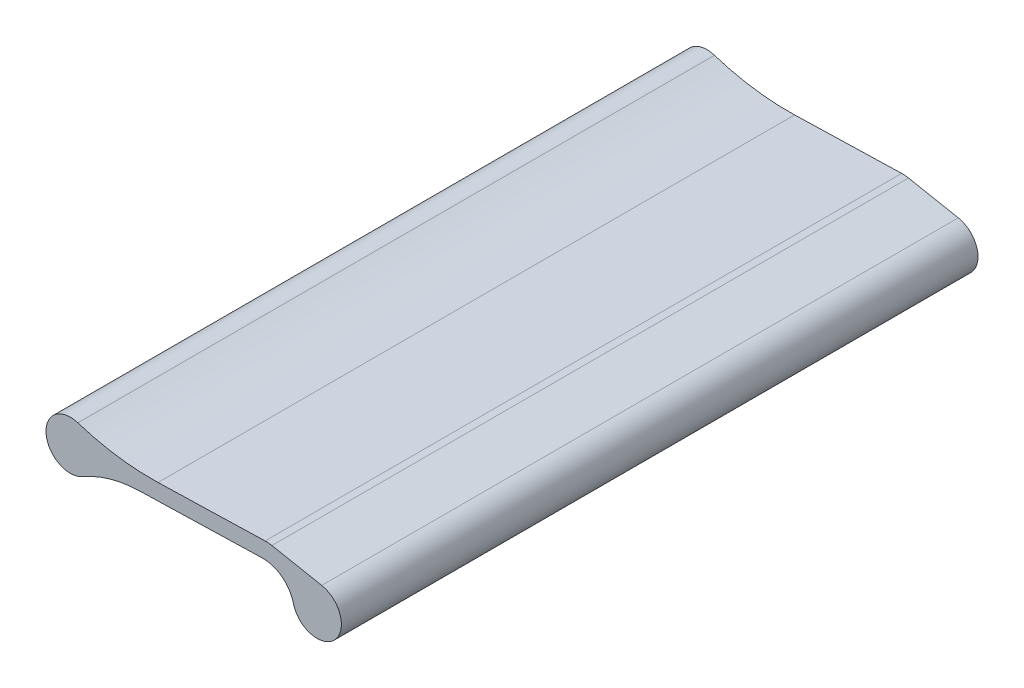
ISO-10303-21;
HEADER;
FILE_DESCRIPTION(('STEP AP214'),'2;1');
FILE_NAME('part.step','',(''),(''),'','','');
FILE_SCHEMA(('AUTOMOTIVE_DESIGN { 1 0 10303 214 1 1 1 1 }'));
ENDSEC;
DATA;
#1=APPLICATION_CONTEXT('core data for automotive mechanical design processes');
#2=APPLICATION_PROTOCOL_DEFINITION('international standard','automotive_design',2000,#1);
#3=PRODUCT_CONTEXT('',#1,'mechanical');
#4=PRODUCT('Part','Part','',(#3));
#5=PRODUCT_RELATED_PRODUCT_CATEGORY('part','',(#4));
#6=PRODUCT_DEFINITION_FORMATION('','',#4);
#7=PRODUCT_DEFINITION_CONTEXT('part definition',#1,'design');
#8=PRODUCT_DEFINITION('design','',#6,#7);
#9=PRODUCT_DEFINITION_SHAPE('','',#8);
#10=(LENGTH_UNIT() NAMED_UNIT(*) SI_UNIT(.MILLI.,.METRE.));
#11=(NAMED_UNIT(*) PLANE_ANGLE_UNIT() SI_UNIT($,.RADIAN.));
#12=(NAMED_UNIT(*) SI_UNIT($,.STERADIAN.) SOLID_ANGLE_UNIT());
#13=UNCERTAINTY_MEASURE_WITH_UNIT(LENGTH_MEASURE(1.E-05),#10,'distance_accuracy_value','');
#14=(GEOMETRIC_REPRESENTATION_CONTEXT(3) GLOBAL_UNCERTAINTY_ASSIGNED_CONTEXT((#13)) GLOBAL_UNIT_ASSIGNED_CONTEXT((#10,
#11,#12)) REPRESENTATION_CONTEXT('',''));
#15=CARTESIAN_POINT('',(0.,0.,0.));
#16=DIRECTION('',(0.,0.,1.));
#17=DIRECTION('',(1.,0.,0.));
#18=AXIS2_PLACEMENT_3D('',#15,#16,#17);
#19=CARTESIAN_POINT('',(-21.5440500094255,-0.697506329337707,0.));
#20=DIRECTION('',(0.,0.,1.));
#21=DIRECTION('',(1.,0.,0.));
#22=AXIS2_PLACEMENT_3D('',#19,#20,#21);
#23=CYLINDRICAL_SURFACE('',#22,3.96000000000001);
#24=CARTESIAN_POINT('',(-21.5440500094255,-0.697506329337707,0.));
#25=DIRECTION('',(0.,0.,1.));
#26=DIRECTION('',(1.,0.,0.));
#27=AXIS2_PLACEMENT_3D('',#24,#25,#26);
#28=CIRCLE('',#27,3.96000000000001);
#29=CARTESIAN_POINT('',(-20.7918012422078,3.19038793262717,0.));
#30=VERTEX_POINT('',#29);
#31=CARTESIAN_POINT('',(-21.6511268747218,3.26104574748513,0.));
#32=VERTEX_POINT('',#31);
#33=EDGE_CURVE('E95',#30,#32,#28,.T.);
#34=ORIENTED_EDGE('',*,*,#33,.T.);
#35=DIRECTION('',(0.,0.,1.));
#36=VECTOR('',#35,1.);
#37=CARTESIAN_POINT('',(-21.6511268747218,3.26104574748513,0.));
#38=LINE('',#37,#36);
#39=CARTESIAN_POINT('',(-21.6511268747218,3.26104574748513,80.));
#40=VERTEX_POINT('',#39);
#41=EDGE_CURVE('E93',#40,#32,#38,.F.);
#42=ORIENTED_EDGE('',*,*,#41,.F.);
#43=CARTESIAN_POINT('',(-21.5440500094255,-0.697506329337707,80.));
#44=DIRECTION('',(0.,0.,1.));
#45=DIRECTION('',(1.,0.,0.));
#46=AXIS2_PLACEMENT_3D('',#43,#44,#45);
#47=CIRCLE('',#46,3.96000000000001);
#48=CARTESIAN_POINT('',(-20.7918012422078,3.19038793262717,80.));
#49=VERTEX_POINT('',#48);
#50=EDGE_CURVE('E20',#40,#49,#47,.F.);
#51=ORIENTED_EDGE('',*,*,#50,.T.);
#52=DIRECTION('',(0.,0.,1.));
#53=VECTOR('',#52,1.);
#54=CARTESIAN_POINT('',(-20.7918012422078,3.19038793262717,0.));
#55=LINE('',#54,#53);
#56=EDGE_CURVE('E90',#30,#49,#55,.T.);
#57=ORIENTED_EDGE('',*,*,#56,.F.);
#58=EDGE_LOOP('',(#34,#42,#51,#57));
#59=FACE_BOUND('',#58,.T.);
#60=ADVANCED_FACE('F17',(#59),#23,.T.);
#61=CARTESIAN_POINT('',(-35.9162883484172,32.9261679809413,0.));
#62=DIRECTION('',(0.,0.,1.));
#63=DIRECTION('',(1.,0.,0.));
#64=AXIS2_PLACEMENT_3D('',#61,#62,#63);
#65=CYLINDRICAL_SURFACE('',#64,30.04);
#66=DIRECTION('',(0.,0.,1.));
#67=VECTOR('',#66,1.);
#68=CARTESIAN_POINT('',(-35.1040183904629,2.89715172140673,0.));
#69=LINE('',#68,#67);
#70=CARTESIAN_POINT('',(-35.1040183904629,2.89715172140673,0.));
#71=VERTEX_POINT('',#70);
#72=CARTESIAN_POINT('',(-35.1040183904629,2.89715172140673,80.));
#73=VERTEX_POINT('',#72);
#74=EDGE_CURVE('E125',#71,#73,#69,.T.);
#75=ORIENTED_EDGE('',*,*,#74,.F.);
#76=CARTESIAN_POINT('',(-35.9162883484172,32.9261679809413,0.));
#77=DIRECTION('',(0.,0.,1.));
#78=DIRECTION('',(1.,0.,0.));
#79=AXIS2_PLACEMENT_3D('',#76,#77,#78);
#80=CIRCLE('',#79,30.04);
#81=CARTESIAN_POINT('',(-45.1782071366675,4.34963109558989,0.));
#82=VERTEX_POINT('',#81);
#83=EDGE_CURVE('E140',#71,#82,#80,.F.);
#84=ORIENTED_EDGE('',*,*,#83,.T.);
#85=DIRECTION('',(0.,0.,1.));
#86=VECTOR('',#85,1.);
#87=CARTESIAN_POINT('',(-45.1782071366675,4.34963109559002,0.));
#88=LINE('',#87,#86);
#89=CARTESIAN_POINT('',(-45.1782071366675,4.34963109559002,80.));
#90=VERTEX_POINT('',#89);
#91=EDGE_CURVE('E103',#90,#82,#88,.F.);
#92=ORIENTED_EDGE('',*,*,#91,.F.);
#93=CARTESIAN_POINT('',(-35.9162883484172,32.9261679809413,80.));
#94=DIRECTION('',(0.,0.,1.));
#95=DIRECTION('',(1.,0.,0.));
#96=AXIS2_PLACEMENT_3D('',#93,#94,#95);
#97=CIRCLE('',#96,30.04);
#98=EDGE_CURVE('E119',#73,#90,#97,.F.);
#99=ORIENTED_EDGE('',*,*,#98,.F.);
#100=EDGE_LOOP('',(#75,#84,#92,#99));
#101=FACE_BOUND('',#100,.T.);
#102=ADVANCED_FACE('F175',(#101),#65,.F.);
#103=CARTESIAN_POINT('',(-46.1216649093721,1.43870556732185,0.));
#104=DIRECTION('',(0.,0.,1.));
#105=DIRECTION('',(1.,0.,0.));
#106=AXIS2_PLACEMENT_3D('',#103,#104,#105);
#107=CYLINDRICAL_SURFACE('',#106,3.06);
#108=CARTESIAN_POINT('',(-46.1216649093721,1.43870556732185,0.));
#109=DIRECTION('',(0.,0.,1.));
#110=DIRECTION('',(1.,0.,0.));
#111=AXIS2_PLACEMENT_3D('',#108,#109,#110);
#112=CIRCLE('',#111,3.06);
#113=CARTESIAN_POINT('',(-44.587359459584,-1.20884174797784,0.));
#114=VERTEX_POINT('',#113);
#115=EDGE_CURVE('E138',#82,#114,#112,.T.);
#116=ORIENTED_EDGE('',*,*,#115,.T.);
#117=DIRECTION('',(0.,0.,1.));
#118=VECTOR('',#117,1.);
#119=CARTESIAN_POINT('',(-44.587359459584,-1.20884174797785,0.));
#120=LINE('',#119,#118);
#121=CARTESIAN_POINT('',(-44.587359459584,-1.20884174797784,80.));
#122=VERTEX_POINT('',#121);
#123=EDGE_CURVE('E108',#114,#122,#120,.T.);
#124=ORIENTED_EDGE('',*,*,#123,.T.);
#125=CARTESIAN_POINT('',(-46.1216649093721,1.43870556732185,80.));
#126=DIRECTION('',(0.,0.,1.));
#127=DIRECTION('',(1.,0.,0.));
#128=AXIS2_PLACEMENT_3D('',#125,#126,#127);
#129=CIRCLE('',#128,3.06);
#130=EDGE_CURVE('E112',#90,#122,#129,.T.);
#131=ORIENTED_EDGE('',*,*,#130,.F.);
#132=ORIENTED_EDGE('',*,*,#91,.T.);
#133=EDGE_LOOP('',(#116,#124,#131,#132));
#134=FACE_BOUND('',#133,.T.);
#135=ADVANCED_FACE('F171',(#134),#107,.T.);
#136=CARTESIAN_POINT('',(-20.7918012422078,3.19038793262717,0.));
#137=DIRECTION('',(0.189961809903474,0.981791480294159,0.));
#138=DIRECTION('',(-0.981791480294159,0.189961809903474,0.));
#139=AXIS2_PLACEMENT_3D('',#136,#137,#138);
#140=PLANE('',#139);
#141=DIRECTION('',(-0.981791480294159,0.189961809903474,0.));
#142=VECTOR('',#141,1.);
#143=CARTESIAN_POINT('',(-14.5380341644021,1.98037853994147,0.));
#144=LINE('',#143,#142);
#145=CARTESIAN_POINT('',(-14.5380341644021,1.98037853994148,0.));
#146=VERTEX_POINT('',#145);
#147=EDGE_CURVE('E102',#146,#30,#144,.T.);
#148=ORIENTED_EDGE('',*,*,#147,.T.);
#149=ORIENTED_EDGE('',*,*,#56,.T.);
#150=DIRECTION('',(-0.981791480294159,0.189961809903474,0.));
#151=VECTOR('',#150,1.);
#152=CARTESIAN_POINT('',(-14.5380341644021,1.98037853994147,80.));
#153=LINE('',#152,#151);
#154=CARTESIAN_POINT('',(-14.5380341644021,1.98037853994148,80.));
#155=VERTEX_POINT('',#154);
#156=EDGE_CURVE('E99',#155,#49,#153,.T.);
#157=ORIENTED_EDGE('',*,*,#156,.F.);
#158=DIRECTION('',(0.,0.,1.));
#159=VECTOR('',#158,1.);
#160=CARTESIAN_POINT('',(-14.5380341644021,1.98037853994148,0.));
#161=LINE('',#160,#159);
#162=EDGE_CURVE('E120',#146,#155,#161,.T.);
#163=ORIENTED_EDGE('',*,*,#162,.F.);
#164=EDGE_LOOP('',(#148,#149,#157,#163));
#165=FACE_BOUND('',#164,.T.);
#166=ADVANCED_FACE('F98',(#165),#140,.T.);
#167=CARTESIAN_POINT('',(-35.1040183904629,2.89715172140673,0.));
#168=DIRECTION('',(-0.027039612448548,0.999634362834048,0.));
#169=DIRECTION('',(-0.999634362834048,-0.027039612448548,0.));
#170=AXIS2_PLACEMENT_3D('',#167,#168,#169);
#171=PLANE('',#170);
#172=DIRECTION('',(-0.999634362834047,-0.0270396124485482,0.));
#173=VECTOR('',#172,1.);
#174=CARTESIAN_POINT('',(-21.6511268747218,3.26104574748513,0.));
#175=LINE('',#174,#173);
#176=EDGE_CURVE('E123',#32,#71,#175,.T.);
#177=ORIENTED_EDGE('',*,*,#176,.T.);
#178=ORIENTED_EDGE('',*,*,#74,.T.);
#179=DIRECTION('',(-0.999634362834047,-0.0270396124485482,0.));
#180=VECTOR('',#179,1.);
#181=CARTESIAN_POINT('',(-21.6511268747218,3.26104574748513,80.));
#182=LINE('',#181,#180);
#183=EDGE_CURVE('E117',#40,#73,#182,.T.);
#184=ORIENTED_EDGE('',*,*,#183,.F.);
#185=ORIENTED_EDGE('',*,*,#41,.T.);
#186=EDGE_LOOP('',(#177,#178,#184,#185));
#187=FACE_BOUND('',#186,.T.);
#188=ADVANCED_FACE('F149',(#187),#171,.T.);
#189=CARTESIAN_POINT('',(-15.1193173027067,-1.02390338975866,0.));
#190=DIRECTION('',(0.,0.,1.));
#191=DIRECTION('',(1.,0.,0.));
#192=AXIS2_PLACEMENT_3D('',#189,#190,#191);
#193=CYLINDRICAL_SURFACE('',#192,3.06000000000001);
#194=CARTESIAN_POINT('',(-15.1193173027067,-1.02390338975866,0.));
#195=DIRECTION('',(0.,0.,1.));
#196=DIRECTION('',(1.,0.,0.));
#197=AXIS2_PLACEMENT_3D('',#194,#195,#196);
#198=CIRCLE('',#197,3.06000000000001);
#199=CARTESIAN_POINT('',(-18.089413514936,-1.76019714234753,0.));
#200=VERTEX_POINT('',#199);
#201=EDGE_CURVE('E133',#200,#146,#198,.T.);
#202=ORIENTED_EDGE('',*,*,#201,.T.);
#203=ORIENTED_EDGE('',*,*,#162,.T.);
#204=CARTESIAN_POINT('',(-15.1193173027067,-1.02390338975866,80.));
#205=DIRECTION('',(0.,0.,1.));
#206=DIRECTION('',(1.,0.,0.));
#207=AXIS2_PLACEMENT_3D('',#204,#205,#206);
#208=CIRCLE('',#207,3.06000000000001);
#209=CARTESIAN_POINT('',(-18.089413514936,-1.76019714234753,80.));
#210=VERTEX_POINT('',#209);
#211=EDGE_CURVE('E107',#210,#155,#208,.T.);
#212=ORIENTED_EDGE('',*,*,#211,.F.);
#213=DIRECTION('',(0.,0.,1.));
#214=VECTOR('',#213,1.);
#215=CARTESIAN_POINT('',(-18.089413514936,-1.76019714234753,0.));
#216=LINE('',#215,#214);
#217=EDGE_CURVE('E121',#210,#200,#216,.F.);
#218=ORIENTED_EDGE('',*,*,#217,.T.);
#219=EDGE_LOOP('',(#202,#203,#212,#218));
#220=FACE_BOUND('',#219,.T.);
#221=ADVANCED_FACE('F198',(#220),#193,.T.);
#222=CARTESIAN_POINT('',(-30.3199559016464,1.26063783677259,80.));
#223=DIRECTION('',(0.,0.,1.));
#224=DIRECTION('',(1.,0.,0.));
#225=AXIS2_PLACEMENT_3D('',#222,#223,#224);
#226=PLANE('',#225);
#227=ORIENTED_EDGE('',*,*,#211,.T.);
#228=ORIENTED_EDGE('',*,*,#156,.T.);
#229=ORIENTED_EDGE('',*,*,#50,.F.);
#230=ORIENTED_EDGE('',*,*,#183,.T.);
#231=ORIENTED_EDGE('',*,*,#98,.T.);
#232=ORIENTED_EDGE('',*,*,#130,.T.);
#233=CARTESIAN_POINT('',(-37.0461980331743,-14.2216233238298,80.));
#234=DIRECTION('',(0.,0.,1.));
#235=DIRECTION('',(1.,0.,0.));
#236=AXIS2_PLACEMENT_3D('',#233,#234,#235);
#237=CIRCLE('',#236,15.04);
#238=CARTESIAN_POINT('',(-37.4528738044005,0.812877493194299,80.));
#239=VERTEX_POINT('',#238);
#240=EDGE_CURVE('E110',#122,#239,#237,.F.);
#241=ORIENTED_EDGE('',*,*,#240,.T.);
#242=DIRECTION('',(0.999634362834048,0.027039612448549,0.));
#243=VECTOR('',#242,1.);
#244=CARTESIAN_POINT('',(-22.0201911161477,1.2303238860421,80.));
#245=LINE('',#244,#243);
#246=CARTESIAN_POINT('',(-22.0201911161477,1.2303238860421,80.));
#247=VERTEX_POINT('',#246);
#248=EDGE_CURVE('E116',#247,#239,#245,.F.);
#249=ORIENTED_EDGE('',*,*,#248,.F.);
#250=CARTESIAN_POINT('',(-21.9136550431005,-2.70823550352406,80.));
#251=DIRECTION('',(0.,0.,1.));
#252=DIRECTION('',(1.,0.,0.));
#253=AXIS2_PLACEMENT_3D('',#250,#251,#252);
#254=CIRCLE('',#253,3.94000000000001);
#255=EDGE_CURVE('E130',#247,#210,#254,.F.);
#256=ORIENTED_EDGE('',*,*,#255,.T.);
#257=EDGE_LOOP('',(#227,#228,#229,#230,#231,#232,#241,#249,#256));
#258=FACE_BOUND('',#257,.T.);
#259=ADVANCED_FACE('F105',(#258),#226,.T.);
#260=CARTESIAN_POINT('',(-37.0461980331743,-14.2216233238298,0.));
#261=DIRECTION('',(0.,0.,1.));
#262=DIRECTION('',(1.,0.,0.));
#263=AXIS2_PLACEMENT_3D('',#260,#261,#262);
#264=CYLINDRICAL_SURFACE('',#263,15.04);
#265=ORIENTED_EDGE('',*,*,#123,.F.);
#266=CARTESIAN_POINT('',(-37.0461980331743,-14.2216233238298,0.));
#267=DIRECTION('',(0.,0.,1.));
#268=DIRECTION('',(1.,0.,0.));
#269=AXIS2_PLACEMENT_3D('',#266,#267,#268);
#270=CIRCLE('',#269,15.04);
#271=CARTESIAN_POINT('',(-37.4528738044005,0.812877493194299,0.));
#272=VERTEX_POINT('',#271);
#273=EDGE_CURVE('E136',#114,#272,#270,.F.);
#274=ORIENTED_EDGE('',*,*,#273,.T.);
#275=DIRECTION('',(0.,0.,1.));
#276=VECTOR('',#275,1.);
#277=CARTESIAN_POINT('',(-37.4528738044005,0.812877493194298,0.));
#278=LINE('',#277,#276);
#279=EDGE_CURVE('E156',#239,#272,#278,.F.);
#280=ORIENTED_EDGE('',*,*,#279,.F.);
#281=ORIENTED_EDGE('',*,*,#240,.F.);
#282=EDGE_LOOP('',(#265,#274,#280,#281));
#283=FACE_BOUND('',#282,.T.);
#284=ADVANCED_FACE('F167',(#283),#264,.F.);
#285=CARTESIAN_POINT('',(-30.3199559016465,1.26063783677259,0.));
#286=DIRECTION('',(0.,0.,1.));
#287=DIRECTION('',(1.,0.,0.));
#288=AXIS2_PLACEMENT_3D('',#285,#286,#287);
#289=PLANE('',#288);
#290=ORIENTED_EDGE('',*,*,#33,.F.);
#291=ORIENTED_EDGE('',*,*,#147,.F.);
#292=ORIENTED_EDGE('',*,*,#201,.F.);
#293=CARTESIAN_POINT('',(-21.9136550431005,-2.70823550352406,0.));
#294=DIRECTION('',(0.,0.,1.));
#295=DIRECTION('',(1.,0.,0.));
#296=AXIS2_PLACEMENT_3D('',#293,#294,#295);
#297=CIRCLE('',#296,3.94000000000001);
#298=CARTESIAN_POINT('',(-22.0201911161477,1.2303238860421,0.));
#299=VERTEX_POINT('',#298);
#300=EDGE_CURVE('E35',#200,#299,#297,.T.);
#301=ORIENTED_EDGE('',*,*,#300,.T.);
#302=DIRECTION('',(0.999634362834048,0.027039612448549,0.));
#303=VECTOR('',#302,1.);
#304=CARTESIAN_POINT('',(-22.0201911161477,1.2303238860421,0.));
#305=LINE('',#304,#303);
#306=EDGE_CURVE('E26',#272,#299,#305,.T.);
#307=ORIENTED_EDGE('',*,*,#306,.F.);
#308=ORIENTED_EDGE('',*,*,#273,.F.);
#309=ORIENTED_EDGE('',*,*,#115,.F.);
#310=ORIENTED_EDGE('',*,*,#83,.F.);
#311=ORIENTED_EDGE('',*,*,#176,.F.);
#312=EDGE_LOOP('',(#290,#291,#292,#301,#307,#308,#309,#310,#311));
#313=FACE_BOUND('',#312,.T.);
#314=ADVANCED_FACE('F151',(#313),#289,.F.);
#315=CARTESIAN_POINT('',(-21.9136550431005,-2.70823550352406,0.));
#316=DIRECTION('',(0.,0.,1.));
#317=DIRECTION('',(1.,0.,0.));
#318=AXIS2_PLACEMENT_3D('',#315,#316,#317);
#319=CYLINDRICAL_SURFACE('',#318,3.94000000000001);
#320=DIRECTION('',(0.,0.,1.));
#321=VECTOR('',#320,1.);
#322=CARTESIAN_POINT('',(-22.0201911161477,1.2303238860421,0.));
#323=LINE('',#322,#321);
#324=EDGE_CURVE('E11',#299,#247,#323,.T.);
#325=ORIENTED_EDGE('',*,*,#324,.F.);
#326=ORIENTED_EDGE('',*,*,#300,.F.);
#327=ORIENTED_EDGE('',*,*,#217,.F.);
#328=ORIENTED_EDGE('',*,*,#255,.F.);
#329=EDGE_LOOP('',(#325,#326,#327,#328));
#330=FACE_BOUND('',#329,.T.);
#331=ADVANCED_FACE('F184',(#330),#319,.F.);
#332=CARTESIAN_POINT('',(-22.0201911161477,1.2303238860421,0.));
#333=DIRECTION('',(0.027039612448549,-0.999634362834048,0.));
#334=DIRECTION('',(0.999634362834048,0.027039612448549,0.));
#335=AXIS2_PLACEMENT_3D('',#332,#333,#334);
#336=PLANE('',#335);
#337=ORIENTED_EDGE('',*,*,#306,.T.);
#338=ORIENTED_EDGE('',*,*,#324,.T.);
#339=ORIENTED_EDGE('',*,*,#248,.T.);
#340=ORIENTED_EDGE('',*,*,#279,.T.);
#341=EDGE_LOOP('',(#337,#338,#339,#340));
#342=FACE_BOUND('',#341,.T.);
#343=ADVANCED_FACE('F161',(#342),#336,.T.);
#344=CLOSED_SHELL('',(#60,#102,#135,#166,#188,#221,#259,#284,#314,#331,#343));
#345=MANIFOLD_SOLID_BREP('B1',#344);
#346=ADVANCED_BREP_SHAPE_REPRESENTATION('',(#18,#345),#14);
#347=SHAPE_DEFINITION_REPRESENTATION(#9,#346);
ENDSEC;
END-ISO-10303-21;
